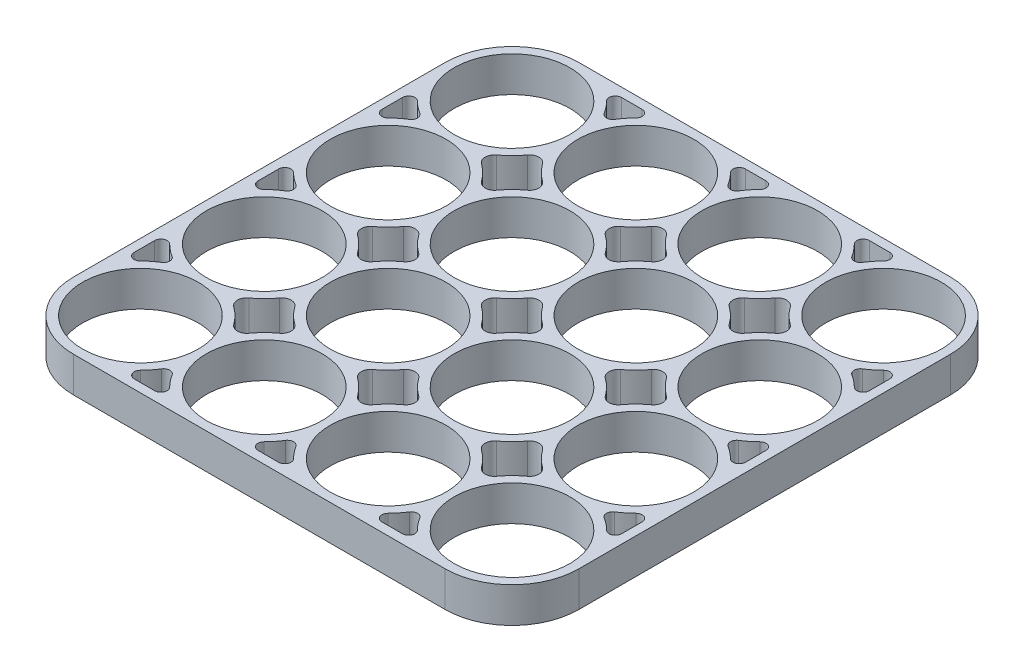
from build123d import *

# Parameters (mm, degrees)
SKIZZE1_R                       = 9.35
AUFSATZ_LINEAR_AUSTRAGEN1_DEPTH = 5.7


with BuildPart() as part:
    # Skizze1 → Aufsatz-Linear austragen1 (new body)
    with BuildSketch(Plane(origin=(0, 0, 0), x_dir=(1, 0, 0), z_dir=(0, 1, 0))):
        with BuildLine():
            Line((-40.8, 30), (-40.8, -30))
            ThreePointArc((-40.8, -30), (-37.636753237, -37.636753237), (-30, -40.8))
            Line((-30, -40.8), (30, -40.8))
            ThreePointArc((30, -40.8), (37.636753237, -37.636753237), (40.8, -30))
            Line((40.8, -30), (40.8, 30))
            ThreePointArc((40.8, 30), (37.636753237, 37.636753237), (30, 40.8))
            Line((30, 40.8), (-30, 40.8))
            ThreePointArc((-30, 40.8), (-37.636753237, 37.636753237), (-40.8, 30))
        make_face()
        with Locations(Location((-30, 30, 0), (0, 0, 270))):
            Circle(SKIZZE1_R, mode=Mode.SUBTRACT)
        with Locations(Location((-10, 30, 0), (0, 0, 270))):
            Circle(SKIZZE1_R, mode=Mode.SUBTRACT)
        with Locations(Location((10, 30, 0), (0, 0, 270))):
            Circle(SKIZZE1_R, mode=Mode.SUBTRACT)
        with Locations(Location((30, 30, 0), (0, 0, 270))):
            Circle(SKIZZE1_R, mode=Mode.SUBTRACT)
        with Locations(Location((-30, 10, 0), (0, 0, 270))):
            Circle(SKIZZE1_R, mode=Mode.SUBTRACT)
        with Locations(Location((-30, -10, 0), (0, 0, 270))):
            Circle(SKIZZE1_R, mode=Mode.SUBTRACT)
        with Locations(Location((-30, -30, 0), (0, 0, 270))):
            Circle(SKIZZE1_R, mode=Mode.SUBTRACT)
        with Locations(Location((-10, 10, 0), (0, 0, 270))):
            Circle(SKIZZE1_R, mode=Mode.SUBTRACT)
        with Locations(Location((10, 10, 0), (0, 0, 270))):
            Circle(SKIZZE1_R, mode=Mode.SUBTRACT)
        with Locations(Location((30, 10, 0), (0, 0, 270))):
            Circle(SKIZZE1_R, mode=Mode.SUBTRACT)
        with Locations(Location((-10, -10, 0), (0, 0, 270))):
            Circle(SKIZZE1_R, mode=Mode.SUBTRACT)
        with Locations(Location((10, -10, 0), (0, 0, 270))):
            Circle(SKIZZE1_R, mode=Mode.SUBTRACT)
        with Locations(Location((30, -10, 0), (0, 0, 270))):
            Circle(SKIZZE1_R, mode=Mode.SUBTRACT)
        with Locations(Location((-10, -30, 0), (0, 0, 270))):
            Circle(SKIZZE1_R, mode=Mode.SUBTRACT)
        with Locations(Location((10, -30, 0), (0, 0, 270))):
            Circle(SKIZZE1_R, mode=Mode.SUBTRACT)
        with Locations(Location((30, -30, 0), (0, 0, 270))):
            Circle(SKIZZE1_R, mode=Mode.SUBTRACT)
        with BuildLine():
            Line((-39.35, -21.662284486), (-39.35, -18.337715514))
            ThreePointArc((-39.35, -18.337715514), (-38.732343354, -17.41369519), (-37.642372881, -17.631129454))
            ThreePointArc((-37.642372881, -17.631129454), (-36.730970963, -18.445947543), (-35.733320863, -19.152542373))
            ThreePointArc((-35.733320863, -19.152542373), (-35.264183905, -20), (-35.733320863, -20.847457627))
            ThreePointArc((-35.733320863, -20.847457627), (-36.730970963, -21.554052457), (-37.642372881, -22.368870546))
            ThreePointArc((-37.642372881, -22.368870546), (-38.732343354, -22.58630481), (-39.35, -21.662284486))
        make_face(mode=Mode.SUBTRACT)
        with BuildLine():
            Line((-39.35, 18.337715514), (-39.35, 21.662284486))
            ThreePointArc((-39.35, 21.662284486), (-38.732343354, 22.58630481), (-37.642372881, 22.368870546))
            ThreePointArc((-37.642372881, 22.368870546), (-36.730970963, 21.554052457), (-35.733320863, 20.847457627))
            ThreePointArc((-35.733320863, 20.847457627), (-35.264183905, 20), (-35.733320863, 19.152542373))
            ThreePointArc((-35.733320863, 19.152542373), (-36.730970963, 18.445947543), (-37.642372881, 17.631129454))
            ThreePointArc((-37.642372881, 17.631129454), (-38.732343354, 17.41369519), (-39.35, 18.337715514))
        make_face(mode=Mode.SUBTRACT)
        with BuildLine():
            Line((-39.35, -1.662284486), (-39.35, 1.662284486))
            ThreePointArc((-39.35, 1.662284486), (-38.732343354, 2.58630481), (-37.642372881, 2.368870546))
            ThreePointArc((-37.642372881, 2.368870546), (-36.730970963, 1.554052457), (-35.733320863, 0.847457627))
            ThreePointArc((-35.733320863, 0.847457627), (-35.264183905, 0), (-35.733320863, -0.847457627))
            ThreePointArc((-35.733320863, -0.847457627), (-36.730970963, -1.554052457), (-37.642372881, -2.368870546))
            ThreePointArc((-37.642372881, -2.368870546), (-38.732343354, -2.58630481), (-39.35, -1.662284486))
        make_face(mode=Mode.SUBTRACT)
        with BuildLine():
            Line((21.662284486, -39.35), (18.337715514, -39.35))
            ThreePointArc((18.337715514, -39.35), (17.41369519, -38.732343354), (17.631129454, -37.642372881))
            ThreePointArc((17.631129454, -37.642372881), (18.445947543, -36.730970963), (19.152542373, -35.733320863))
            ThreePointArc((19.152542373, -35.733320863), (20, -35.264183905), (20.847457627, -35.733320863))
            ThreePointArc((20.847457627, -35.733320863), (21.554052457, -36.730970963), (22.368870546, -37.642372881))
            ThreePointArc((22.368870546, -37.642372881), (22.58630481, -38.732343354), (21.662284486, -39.35))
        make_face(mode=Mode.SUBTRACT)
        with BuildLine():
            Line((-18.337715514, -39.35), (-21.662284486, -39.35))
            ThreePointArc((-21.662284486, -39.35), (-22.58630481, -38.732343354), (-22.368870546, -37.642372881))
            ThreePointArc((-22.368870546, -37.642372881), (-21.554052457, -36.730970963), (-20.847457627, -35.733320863))
            ThreePointArc((-20.847457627, -35.733320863), (-20, -35.264183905), (-19.152542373, -35.733320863))
            ThreePointArc((-19.152542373, -35.733320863), (-18.445947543, -36.730970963), (-17.631129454, -37.642372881))
            ThreePointArc((-17.631129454, -37.642372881), (-17.41369519, -38.732343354), (-18.337715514, -39.35))
        make_face(mode=Mode.SUBTRACT)
        with BuildLine():
            Line((1.662284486, -39.35), (-1.662284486, -39.35))
            ThreePointArc((-1.662284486, -39.35), (-2.58630481, -38.732343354), (-2.368870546, -37.642372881))
            ThreePointArc((-2.368870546, -37.642372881), (-1.554052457, -36.730970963), (-0.847457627, -35.733320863))
            ThreePointArc((-0.847457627, -35.733320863), (0, -35.264183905), (0.847457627, -35.733320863))
            ThreePointArc((0.847457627, -35.733320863), (1.554052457, -36.730970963), (2.368870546, -37.642372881))
            ThreePointArc((2.368870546, -37.642372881), (2.58630481, -38.732343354), (1.662284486, -39.35))
        make_face(mode=Mode.SUBTRACT)
        with BuildLine():
            Line((39.35, -21.662284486), (39.35, -18.337715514))
            ThreePointArc((39.35, -18.337715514), (38.732343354, -17.41369519), (37.642372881, -17.631129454))
            ThreePointArc((37.642372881, -17.631129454), (36.730970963, -18.445947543), (35.733320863, -19.152542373))
            ThreePointArc((35.733320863, -19.152542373), (35.264183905, -20), (35.733320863, -20.847457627))
            ThreePointArc((35.733320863, -20.847457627), (36.730970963, -21.554052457), (37.642372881, -22.368870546))
            ThreePointArc((37.642372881, -22.368870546), (38.732343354, -22.58630481), (39.35, -21.662284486))
        make_face(mode=Mode.SUBTRACT)
        with BuildLine():
            Line((39.35, 18.337715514), (39.35, 21.662284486))
            ThreePointArc((39.35, 21.662284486), (38.732343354, 22.58630481), (37.642372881, 22.368870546))
            ThreePointArc((37.642372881, 22.368870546), (36.730970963, 21.554052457), (35.733320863, 20.847457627))
            ThreePointArc((35.733320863, 20.847457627), (35.264183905, 20), (35.733320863, 19.152542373))
            ThreePointArc((35.733320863, 19.152542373), (36.730970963, 18.445947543), (37.642372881, 17.631129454))
            ThreePointArc((37.642372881, 17.631129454), (38.732343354, 17.41369519), (39.35, 18.337715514))
        make_face(mode=Mode.SUBTRACT)
        with BuildLine():
            Line((39.35, -1.662284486), (39.35, 1.662284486))
            ThreePointArc((39.35, 1.662284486), (38.732343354, 2.58630481), (37.642372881, 2.368870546))
            ThreePointArc((37.642372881, 2.368870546), (36.730970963, 1.554052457), (35.733320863, 0.847457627))
            ThreePointArc((35.733320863, 0.847457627), (35.264183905, 0), (35.733320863, -0.847457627))
            ThreePointArc((35.733320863, -0.847457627), (36.730970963, -1.554052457), (37.642372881, -2.368870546))
            ThreePointArc((37.642372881, -2.368870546), (38.732343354, -2.58630481), (39.35, -1.662284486))
        make_face(mode=Mode.SUBTRACT)
        with BuildLine():
            Line((21.662284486, 39.35), (18.337715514, 39.35))
            ThreePointArc((18.337715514, 39.35), (17.41369519, 38.732343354), (17.631129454, 37.642372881))
            ThreePointArc((17.631129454, 37.642372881), (18.445947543, 36.730970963), (19.152542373, 35.733320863))
            ThreePointArc((19.152542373, 35.733320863), (20, 35.264183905), (20.847457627, 35.733320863))
            ThreePointArc((20.847457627, 35.733320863), (21.554052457, 36.730970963), (22.368870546, 37.642372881))
            ThreePointArc((22.368870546, 37.642372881), (22.58630481, 38.732343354), (21.662284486, 39.35))
        make_face(mode=Mode.SUBTRACT)
        with BuildLine():
            Line((-18.337715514, 39.35), (-21.662284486, 39.35))
            ThreePointArc((-21.662284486, 39.35), (-22.58630481, 38.732343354), (-22.368870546, 37.642372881))
            ThreePointArc((-22.368870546, 37.642372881), (-21.554052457, 36.730970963), (-20.847457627, 35.733320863))
            ThreePointArc((-20.847457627, 35.733320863), (-20, 35.264183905), (-19.152542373, 35.733320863))
            ThreePointArc((-19.152542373, 35.733320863), (-18.445947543, 36.730970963), (-17.631129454, 37.642372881))
            ThreePointArc((-17.631129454, 37.642372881), (-17.41369519, 38.732343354), (-18.337715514, 39.35))
        make_face(mode=Mode.SUBTRACT)
        with BuildLine():
            Line((1.662284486, 39.35), (-1.662284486, 39.35))
            ThreePointArc((-1.662284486, 39.35), (-2.58630481, 38.732343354), (-2.368870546, 37.642372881))
            ThreePointArc((-2.368870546, 37.642372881), (-1.554052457, 36.730970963), (-0.847457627, 35.733320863))
            ThreePointArc((-0.847457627, 35.733320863), (0, 35.264183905), (0.847457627, 35.733320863))
            ThreePointArc((0.847457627, 35.733320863), (1.554052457, 36.730970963), (2.368870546, 37.642372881))
            ThreePointArc((2.368870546, 37.642372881), (2.58630481, 38.732343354), (1.662284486, 39.35))
        make_face(mode=Mode.SUBTRACT)
        with BuildLine():
            ThreePointArc((-23.711674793, 21.219512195), (-22.363246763, 22.363246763), (-21.219512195, 23.711674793))
            ThreePointArc((-21.219512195, 23.711674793), (-20, 24.338296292), (-18.780487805, 23.711674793))
            ThreePointArc((-18.780487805, 23.711674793), (-17.636753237, 22.363246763), (-16.288325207, 21.219512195))
            ThreePointArc((-16.288325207, 21.219512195), (-15.661703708, 20), (-16.288325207, 18.780487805))
            ThreePointArc((-16.288325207, 18.780487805), (-17.636753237, 17.636753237), (-18.780487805, 16.288325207))
            ThreePointArc((-18.780487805, 16.288325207), (-20, 15.661703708), (-21.219512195, 16.288325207))
            ThreePointArc((-21.219512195, 16.288325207), (-22.363246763, 17.636753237), (-23.711674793, 18.780487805))
            ThreePointArc((-23.711674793, 18.780487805), (-24.338296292, 20), (-23.711674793, 21.219512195))
        make_face(mode=Mode.SUBTRACT)
        with BuildLine():
            ThreePointArc((-3.711674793, 21.219512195), (-2.363246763, 22.363246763), (-1.219512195, 23.711674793))
            ThreePointArc((-1.219512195, 23.711674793), (0, 24.338296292), (1.219512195, 23.711674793))
            ThreePointArc((1.219512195, 23.711674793), (2.363246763, 22.363246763), (3.711674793, 21.219512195))
            ThreePointArc((3.711674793, 21.219512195), (4.338296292, 20), (3.711674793, 18.780487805))
            ThreePointArc((3.711674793, 18.780487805), (2.363246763, 17.636753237), (1.219512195, 16.288325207))
            ThreePointArc((1.219512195, 16.288325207), (0, 15.661703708), (-1.219512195, 16.288325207))
            ThreePointArc((-1.219512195, 16.288325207), (-2.363246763, 17.636753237), (-3.711674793, 18.780487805))
            ThreePointArc((-3.711674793, 18.780487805), (-4.338296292, 20), (-3.711674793, 21.219512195))
        make_face(mode=Mode.SUBTRACT)
        with BuildLine():
            ThreePointArc((21.219512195, 3.711674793), (22.363246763, 2.363246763), (23.711674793, 1.219512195))
            ThreePointArc((23.711674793, 1.219512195), (24.338296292, 0), (23.711674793, -1.219512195))
            ThreePointArc((23.711674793, -1.219512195), (22.363246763, -2.363246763), (21.219512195, -3.711674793))
            ThreePointArc((21.219512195, -3.711674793), (20, -4.338296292), (18.780487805, -3.711674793))
            ThreePointArc((18.780487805, -3.711674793), (17.636753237, -2.363246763), (16.288325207, -1.219512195))
            ThreePointArc((16.288325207, -1.219512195), (15.661703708, 0), (16.288325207, 1.219512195))
            ThreePointArc((16.288325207, 1.219512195), (17.636753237, 2.363246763), (18.780487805, 3.711674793))
            ThreePointArc((18.780487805, 3.711674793), (20, 4.338296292), (21.219512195, 3.711674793))
        make_face(mode=Mode.SUBTRACT)
        with BuildLine():
            ThreePointArc((18.780487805, 16.288325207), (17.636753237, 17.636753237), (16.288325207, 18.780487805))
            ThreePointArc((16.288325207, 18.780487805), (15.661703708, 20), (16.288325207, 21.219512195))
            ThreePointArc((16.288325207, 21.219512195), (17.636753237, 22.363246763), (18.780487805, 23.711674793))
            ThreePointArc((18.780487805, 23.711674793), (20, 24.338296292), (21.219512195, 23.711674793))
            ThreePointArc((21.219512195, 23.711674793), (22.363246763, 22.363246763), (23.711674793, 21.219512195))
            ThreePointArc((23.711674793, 21.219512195), (24.338296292, 20), (23.711674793, 18.780487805))
            ThreePointArc((23.711674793, 18.780487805), (22.363246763, 17.636753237), (21.219512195, 16.288325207))
            ThreePointArc((21.219512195, 16.288325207), (20, 15.661703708), (18.780487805, 16.288325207))
        make_face(mode=Mode.SUBTRACT)
        with BuildLine():
            ThreePointArc((-3.711674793, 1.219512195), (-2.363246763, 2.363246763), (-1.219512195, 3.711674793))
            ThreePointArc((-1.219512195, 3.711674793), (0, 4.338296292), (1.219512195, 3.711674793))
            ThreePointArc((1.219512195, 3.711674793), (2.363246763, 2.363246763), (3.711674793, 1.219512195))
            ThreePointArc((3.711674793, 1.219512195), (4.338296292, 0), (3.711674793, -1.219512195))
            ThreePointArc((3.711674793, -1.219512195), (2.363246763, -2.363246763), (1.219512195, -3.711674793))
            ThreePointArc((1.219512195, -3.711674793), (0, -4.338296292), (-1.219512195, -3.711674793))
            ThreePointArc((-1.219512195, -3.711674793), (-2.363246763, -2.363246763), (-3.711674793, -1.219512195))
            ThreePointArc((-3.711674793, -1.219512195), (-4.338296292, 0), (-3.711674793, 1.219512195))
        make_face(mode=Mode.SUBTRACT)
        with BuildLine():
            ThreePointArc((-23.711674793, -18.780487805), (-22.363246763, -17.636753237), (-21.219512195, -16.288325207))
            ThreePointArc((-21.219512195, -16.288325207), (-20, -15.661703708), (-18.780487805, -16.288325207))
            ThreePointArc((-18.780487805, -16.288325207), (-17.636753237, -17.636753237), (-16.288325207, -18.780487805))
            ThreePointArc((-16.288325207, -18.780487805), (-15.661703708, -20), (-16.288325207, -21.219512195))
            ThreePointArc((-16.288325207, -21.219512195), (-17.636753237, -22.363246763), (-18.780487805, -23.711674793))
            ThreePointArc((-18.780487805, -23.711674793), (-20, -24.338296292), (-21.219512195, -23.711674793))
            ThreePointArc((-21.219512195, -23.711674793), (-22.363246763, -22.363246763), (-23.711674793, -21.219512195))
            ThreePointArc((-23.711674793, -21.219512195), (-24.338296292, -20), (-23.711674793, -18.780487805))
        make_face(mode=Mode.SUBTRACT)
        with BuildLine():
            ThreePointArc((23.711674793, -21.219512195), (22.363246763, -22.363246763), (21.219512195, -23.711674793))
            ThreePointArc((21.219512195, -23.711674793), (20, -24.338296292), (18.780487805, -23.711674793))
            ThreePointArc((18.780487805, -23.711674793), (17.636753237, -22.363246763), (16.288325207, -21.219512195))
            ThreePointArc((16.288325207, -21.219512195), (15.661703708, -20), (16.288325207, -18.780487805))
            ThreePointArc((16.288325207, -18.780487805), (17.636753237, -17.636753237), (18.780487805, -16.288325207))
            ThreePointArc((18.780487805, -16.288325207), (20, -15.661703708), (21.219512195, -16.288325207))
            ThreePointArc((21.219512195, -16.288325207), (22.363246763, -17.636753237), (23.711674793, -18.780487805))
            ThreePointArc((23.711674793, -18.780487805), (24.338296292, -20), (23.711674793, -21.219512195))
        make_face(mode=Mode.SUBTRACT)
        with BuildLine():
            ThreePointArc((-1.219512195, -23.711674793), (-2.363246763, -22.363246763), (-3.711674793, -21.219512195))
            ThreePointArc((-3.711674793, -21.219512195), (-4.338296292, -20), (-3.711674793, -18.780487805))
            ThreePointArc((-3.711674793, -18.780487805), (-2.363246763, -17.636753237), (-1.219512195, -16.288325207))
            ThreePointArc((-1.219512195, -16.288325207), (0, -15.661703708), (1.219512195, -16.288325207))
            ThreePointArc((1.219512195, -16.288325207), (2.363246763, -17.636753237), (3.711674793, -18.780487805))
            ThreePointArc((3.711674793, -18.780487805), (4.338296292, -20), (3.711674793, -21.219512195))
            ThreePointArc((3.711674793, -21.219512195), (2.363246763, -22.363246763), (1.219512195, -23.711674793))
            ThreePointArc((1.219512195, -23.711674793), (0, -24.338296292), (-1.219512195, -23.711674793))
        make_face(mode=Mode.SUBTRACT)
        with BuildLine():
            ThreePointArc((-21.219512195, -3.711674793), (-22.363246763, -2.363246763), (-23.711674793, -1.219512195))
            ThreePointArc((-23.711674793, -1.219512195), (-24.338296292, 0), (-23.711674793, 1.219512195))
            ThreePointArc((-23.711674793, 1.219512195), (-22.363246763, 2.363246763), (-21.219512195, 3.711674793))
            ThreePointArc((-21.219512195, 3.711674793), (-20, 4.338296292), (-18.780487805, 3.711674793))
            ThreePointArc((-18.780487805, 3.711674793), (-17.636753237, 2.363246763), (-16.288325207, 1.219512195))
            ThreePointArc((-16.288325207, 1.219512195), (-15.661703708, 0), (-16.288325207, -1.219512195))
            ThreePointArc((-16.288325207, -1.219512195), (-17.636753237, -2.363246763), (-18.780487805, -3.711674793))
            ThreePointArc((-18.780487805, -3.711674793), (-20, -4.338296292), (-21.219512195, -3.711674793))
        make_face(mode=Mode.SUBTRACT)
    extrude(amount=AUFSATZ_LINEAR_AUSTRAGEN1_DEPTH)


solid = part.part
